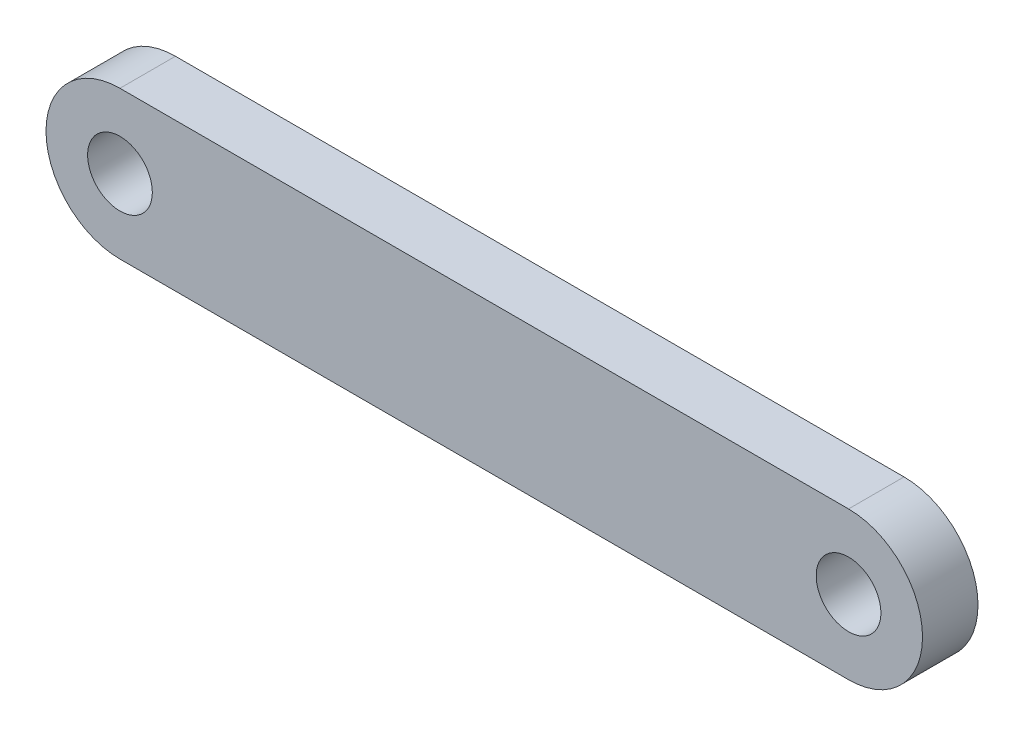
from build123d import *

# Parameters (mm, degrees)
ESQUISSE1_R        = 1.75
BOSS_EXTRU_1_DEPTH = 3


with BuildPart() as part:
    # Esquisse1 → Boss.-Extru.1 (new body)
    with BuildSketch(Plane.XY):
        with BuildLine():
            Line((-39.4, 4), (0, 4))
            ThreePointArc((0, 4), (4, 0), (0, -4))
            Line((0, -4), (-39.4, -4))
            ThreePointArc((-39.4, -4), (-43.4, 0), (-39.4, 4))
        make_face()
        Circle(ESQUISSE1_R, mode=Mode.SUBTRACT)
        with Locations((-39.4, 0)):
            Circle(ESQUISSE1_R, mode=Mode.SUBTRACT)
    extrude(amount=BOSS_EXTRU_1_DEPTH)


solid = part.part
